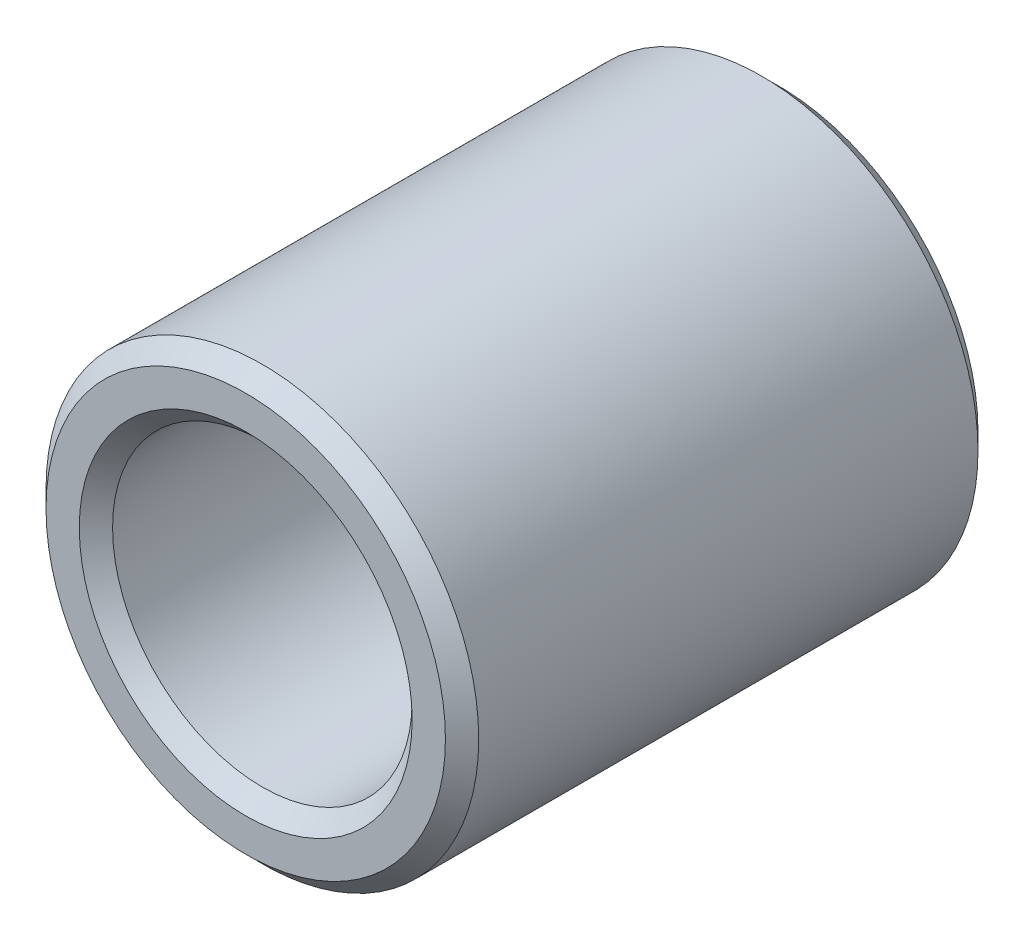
ISO-10303-21;
HEADER;
FILE_DESCRIPTION(('STEP AP214'),'2;1');
FILE_NAME('part.step','',(''),(''),'','','');
FILE_SCHEMA(('AUTOMOTIVE_DESIGN { 1 0 10303 214 1 1 1 1 }'));
ENDSEC;
DATA;
#1=APPLICATION_CONTEXT('core data for automotive mechanical design processes');
#2=APPLICATION_PROTOCOL_DEFINITION('international standard','automotive_design',2000,#1);
#3=PRODUCT_CONTEXT('',#1,'mechanical');
#4=PRODUCT('Part','Part','',(#3));
#5=PRODUCT_RELATED_PRODUCT_CATEGORY('part','',(#4));
#6=PRODUCT_DEFINITION_FORMATION('','',#4);
#7=PRODUCT_DEFINITION_CONTEXT('part definition',#1,'design');
#8=PRODUCT_DEFINITION('design','',#6,#7);
#9=PRODUCT_DEFINITION_SHAPE('','',#8);
#10=(LENGTH_UNIT() NAMED_UNIT(*) SI_UNIT(.MILLI.,.METRE.));
#11=(NAMED_UNIT(*) PLANE_ANGLE_UNIT() SI_UNIT($,.RADIAN.));
#12=(NAMED_UNIT(*) SI_UNIT($,.STERADIAN.) SOLID_ANGLE_UNIT());
#13=UNCERTAINTY_MEASURE_WITH_UNIT(LENGTH_MEASURE(1.E-05),#10,'distance_accuracy_value','');
#14=(GEOMETRIC_REPRESENTATION_CONTEXT(3) GLOBAL_UNCERTAINTY_ASSIGNED_CONTEXT((#13)) GLOBAL_UNIT_ASSIGNED_CONTEXT((#10,
#11,#12)) REPRESENTATION_CONTEXT('',''));
#15=CARTESIAN_POINT('',(0.,0.,0.));
#16=DIRECTION('',(0.,0.,1.));
#17=DIRECTION('',(1.,0.,0.));
#18=AXIS2_PLACEMENT_3D('',#15,#16,#17);
#19=CARTESIAN_POINT('',(0.,0.,16.));
#20=DIRECTION('',(0.,0.,1.));
#21=DIRECTION('',(1.,0.,0.));
#22=AXIS2_PLACEMENT_3D('',#19,#20,#21);
#23=PLANE('',#22);
#24=CARTESIAN_POINT('',(0.,0.,16.));
#25=DIRECTION('',(0.,0.,1.));
#26=DIRECTION('',(1.,0.,0.));
#27=AXIS2_PLACEMENT_3D('',#24,#25,#26);
#28=CIRCLE('',#27,5.99999999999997);
#29=CARTESIAN_POINT('',(5.99999999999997,0.,16.));
#30=VERTEX_POINT('',#29);
#31=EDGE_CURVE('E51',#30,#30,#28,.T.);
#32=ORIENTED_EDGE('',*,*,#31,.T.);
#33=EDGE_LOOP('',(#32));
#34=FACE_BOUND('',#33,.T.);
#35=CARTESIAN_POINT('',(0.,0.,16.));
#36=DIRECTION('',(0.,0.,1.));
#37=DIRECTION('',(1.,0.,0.));
#38=AXIS2_PLACEMENT_3D('',#35,#36,#37);
#39=CIRCLE('',#38,5.);
#40=CARTESIAN_POINT('',(5.,0.,16.));
#41=VERTEX_POINT('',#40);
#42=EDGE_CURVE('E54',#41,#41,#39,.F.);
#43=ORIENTED_EDGE('',*,*,#42,.T.);
#44=EDGE_LOOP('',(#43));
#45=FACE_BOUND('',#44,.T.);
#46=ADVANCED_FACE('F25',(#34,#45),#23,.T.);
#47=CARTESIAN_POINT('',(0.,0.,0.));
#48=DIRECTION('',(0.,0.,1.));
#49=DIRECTION('',(1.,0.,0.));
#50=AXIS2_PLACEMENT_3D('',#47,#48,#49);
#51=PLANE('',#50);
#52=CARTESIAN_POINT('',(0.,0.,0.));
#53=DIRECTION('',(0.,0.,1.));
#54=DIRECTION('',(1.,0.,0.));
#55=AXIS2_PLACEMENT_3D('',#52,#53,#54);
#56=CIRCLE('',#55,5.99999999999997);
#57=CARTESIAN_POINT('',(5.99999999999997,0.,0.));
#58=VERTEX_POINT('',#57);
#59=EDGE_CURVE('E10',#58,#58,#56,.F.);
#60=ORIENTED_EDGE('',*,*,#59,.T.);
#61=EDGE_LOOP('',(#60));
#62=FACE_BOUND('',#61,.T.);
#63=CARTESIAN_POINT('',(0.,0.,0.));
#64=DIRECTION('',(0.,0.,1.));
#65=DIRECTION('',(1.,0.,0.));
#66=AXIS2_PLACEMENT_3D('',#63,#64,#65);
#67=CIRCLE('',#66,5.);
#68=CARTESIAN_POINT('',(5.,0.,0.));
#69=VERTEX_POINT('',#68);
#70=EDGE_CURVE('E32',#69,#69,#67,.T.);
#71=ORIENTED_EDGE('',*,*,#70,.T.);
#72=EDGE_LOOP('',(#71));
#73=FACE_BOUND('',#72,.T.);
#74=ADVANCED_FACE('F83',(#62,#73),#51,.F.);
#75=CARTESIAN_POINT('',(0.,0.,16.));
#76=DIRECTION('',(0.,0.,-1.));
#77=DIRECTION('',(-1.,0.,0.));
#78=AXIS2_PLACEMENT_3D('',#75,#76,#77);
#79=CYLINDRICAL_SURFACE('',#78,6.49999999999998);
#80=CARTESIAN_POINT('',(0.,0.,15.5));
#81=DIRECTION('',(0.,0.,1.));
#82=DIRECTION('',(1.,0.,0.));
#83=AXIS2_PLACEMENT_3D('',#80,#81,#82);
#84=CIRCLE('',#83,6.49999999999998);
#85=CARTESIAN_POINT('',(6.49999999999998,0.,15.5));
#86=VERTEX_POINT('',#85);
#87=EDGE_CURVE('E45',#86,#86,#84,.F.);
#88=ORIENTED_EDGE('',*,*,#87,.T.);
#89=EDGE_LOOP('',(#88));
#90=FACE_BOUND('',#89,.T.);
#91=CARTESIAN_POINT('',(0.,0.,0.500000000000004));
#92=DIRECTION('',(0.,0.,1.));
#93=DIRECTION('',(1.,0.,0.));
#94=AXIS2_PLACEMENT_3D('',#91,#92,#93);
#95=CIRCLE('',#94,6.49999999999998);
#96=CARTESIAN_POINT('',(6.49999999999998,0.,0.500000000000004));
#97=VERTEX_POINT('',#96);
#98=EDGE_CURVE('E48',#97,#97,#95,.T.);
#99=ORIENTED_EDGE('',*,*,#98,.T.);
#100=EDGE_LOOP('',(#99));
#101=FACE_BOUND('',#100,.T.);
#102=ADVANCED_FACE('F27',(#90,#101),#79,.T.);
#103=CARTESIAN_POINT('',(0.,0.,16.));
#104=DIRECTION('',(0.,0.,-1.));
#105=DIRECTION('',(-1.,0.,0.));
#106=AXIS2_PLACEMENT_3D('',#103,#104,#105);
#107=CYLINDRICAL_SURFACE('',#106,4.49999999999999);
#108=CARTESIAN_POINT('',(0.,0.,15.5));
#109=DIRECTION('',(0.,0.,1.));
#110=DIRECTION('',(1.,0.,0.));
#111=AXIS2_PLACEMENT_3D('',#108,#109,#110);
#112=CIRCLE('',#111,4.49999999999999);
#113=CARTESIAN_POINT('',(4.49999999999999,0.,15.5));
#114=VERTEX_POINT('',#113);
#115=EDGE_CURVE('E36',#114,#114,#112,.T.);
#116=ORIENTED_EDGE('',*,*,#115,.T.);
#117=EDGE_LOOP('',(#116));
#118=FACE_BOUND('',#117,.T.);
#119=CARTESIAN_POINT('',(0.,0.,0.500000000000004));
#120=DIRECTION('',(0.,0.,1.));
#121=DIRECTION('',(1.,0.,0.));
#122=AXIS2_PLACEMENT_3D('',#119,#120,#121);
#123=CIRCLE('',#122,4.49999999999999);
#124=CARTESIAN_POINT('',(4.49999999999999,0.,0.500000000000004));
#125=VERTEX_POINT('',#124);
#126=EDGE_CURVE('E40',#125,#125,#123,.F.);
#127=ORIENTED_EDGE('',*,*,#126,.T.);
#128=EDGE_LOOP('',(#127));
#129=FACE_BOUND('',#128,.T.);
#130=ADVANCED_FACE('F67',(#118,#129),#107,.F.);
#131=CARTESIAN_POINT('',(0.,0.,16.));
#132=DIRECTION('',(0.,0.,-1.));
#133=DIRECTION('',(-1.,0.,0.));
#134=AXIS2_PLACEMENT_3D('',#131,#132,#133);
#135=CONICAL_SURFACE('',#134,5.99999999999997,0.785398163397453);
#136=ORIENTED_EDGE('',*,*,#87,.F.);
#137=EDGE_LOOP('',(#136));
#138=FACE_BOUND('',#137,.T.);
#139=ORIENTED_EDGE('',*,*,#31,.F.);
#140=EDGE_LOOP('',(#139));
#141=FACE_BOUND('',#140,.T.);
#142=ADVANCED_FACE('F63',(#138,#141),#135,.T.);
#143=CARTESIAN_POINT('',(0.,0.,15.5));
#144=DIRECTION('',(0.,0.,1.));
#145=DIRECTION('',(1.,0.,0.));
#146=AXIS2_PLACEMENT_3D('',#143,#144,#145);
#147=CONICAL_SURFACE('',#146,4.49999999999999,0.785398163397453);
#148=ORIENTED_EDGE('',*,*,#42,.F.);
#149=EDGE_LOOP('',(#148));
#150=FACE_BOUND('',#149,.T.);
#151=ORIENTED_EDGE('',*,*,#115,.F.);
#152=EDGE_LOOP('',(#151));
#153=FACE_BOUND('',#152,.T.);
#154=ADVANCED_FACE('F59',(#150,#153),#147,.F.);
#155=CARTESIAN_POINT('',(0.,0.,0.500000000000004));
#156=DIRECTION('',(0.,0.,1.));
#157=DIRECTION('',(1.,0.,0.));
#158=AXIS2_PLACEMENT_3D('',#155,#156,#157);
#159=CONICAL_SURFACE('',#158,6.49999999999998,0.785398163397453);
#160=ORIENTED_EDGE('',*,*,#59,.F.);
#161=EDGE_LOOP('',(#160));
#162=FACE_BOUND('',#161,.T.);
#163=ORIENTED_EDGE('',*,*,#98,.F.);
#164=EDGE_LOOP('',(#163));
#165=FACE_BOUND('',#164,.T.);
#166=ADVANCED_FACE('F62',(#162,#165),#159,.T.);
#167=CARTESIAN_POINT('',(0.,0.,0.));
#168=DIRECTION('',(0.,0.,-1.));
#169=DIRECTION('',(-1.,0.,0.));
#170=AXIS2_PLACEMENT_3D('',#167,#168,#169);
#171=CONICAL_SURFACE('',#170,5.,0.785398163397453);
#172=ORIENTED_EDGE('',*,*,#126,.F.);
#173=EDGE_LOOP('',(#172));
#174=FACE_BOUND('',#173,.T.);
#175=ORIENTED_EDGE('',*,*,#70,.F.);
#176=EDGE_LOOP('',(#175));
#177=FACE_BOUND('',#176,.T.);
#178=ADVANCED_FACE('F73',(#174,#177),#171,.F.);
#179=CLOSED_SHELL('',(#46,#74,#102,#130,#142,#154,#166,#178));
#180=MANIFOLD_SOLID_BREP('B2',#179);
#181=ADVANCED_BREP_SHAPE_REPRESENTATION('',(#18,#180),#14);
#182=SHAPE_DEFINITION_REPRESENTATION(#9,#181);
ENDSEC;
END-ISO-10303-21;
